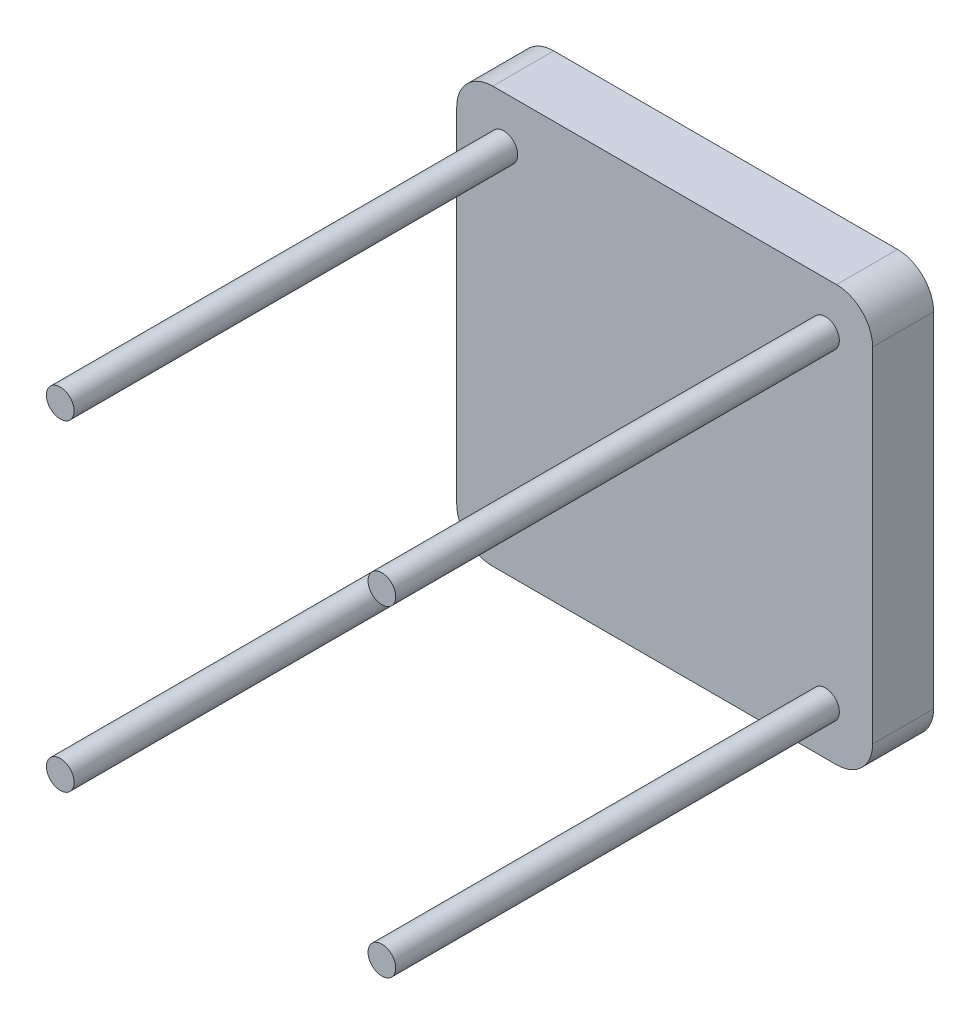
from build123d import *

# Parameters (mm, degrees)
ESQUISSE1_W                     = 150
ESQUISSE1_H                     = 150
EXTRUSION1_DEPTH                = 22
CONG_1_R                        = 13
ESQUISSE2_R                     = 5
EXTRUSION2_DEPTH                = 160
R_P_TITION_LIN_AIRE1_COUNT      = 2
R_P_TITION_LIN_AIRE1_PITCH      = 116
R_P_TITION_LIN_AIRE1_COUNT_DIR2 = 2
R_P_TITION_LIN_AIRE1_PITCH_DIR2 = 116


with BuildPart() as part:
    # Esquisse1 → Extrusion1 (new body)
    with BuildSketch(Plane.XY):
        with Locations((75, 75)):
            Rectangle(ESQUISSE1_W, ESQUISSE1_H)
    extrude(amount=EXTRUSION1_DEPTH)

    # Cong_1
    cong_1_edges = [part.edges().sort_by_distance(p)[0] for p in [
        (0, 150, 11),
        (150, 150, 11),
        (150, 0, 11),
        (0, 0, 11),
    ]]
    fillet(cong_1_edges, radius=CONG_1_R)

    # Esquisse2 → Extrusion2 (add)
    with BuildSketch(Plane.XY.offset(22)):
        with Locations(Location((133, 17, 0), (0, 0, 180))):
            Circle(ESQUISSE2_R)
    extrusion2 = extrude(amount=EXTRUSION2_DEPTH)

    # R_p_tition lin_aire1: Extrusion2 2 × 2
    with Locations(*[(-i * R_P_TITION_LIN_AIRE1_PITCH, j * R_P_TITION_LIN_AIRE1_PITCH_DIR2, 0) for i in range(R_P_TITION_LIN_AIRE1_COUNT) for j in range(R_P_TITION_LIN_AIRE1_COUNT_DIR2) if (i, j) != (0, 0)]):
        add(extrusion2)


solid = part.part
